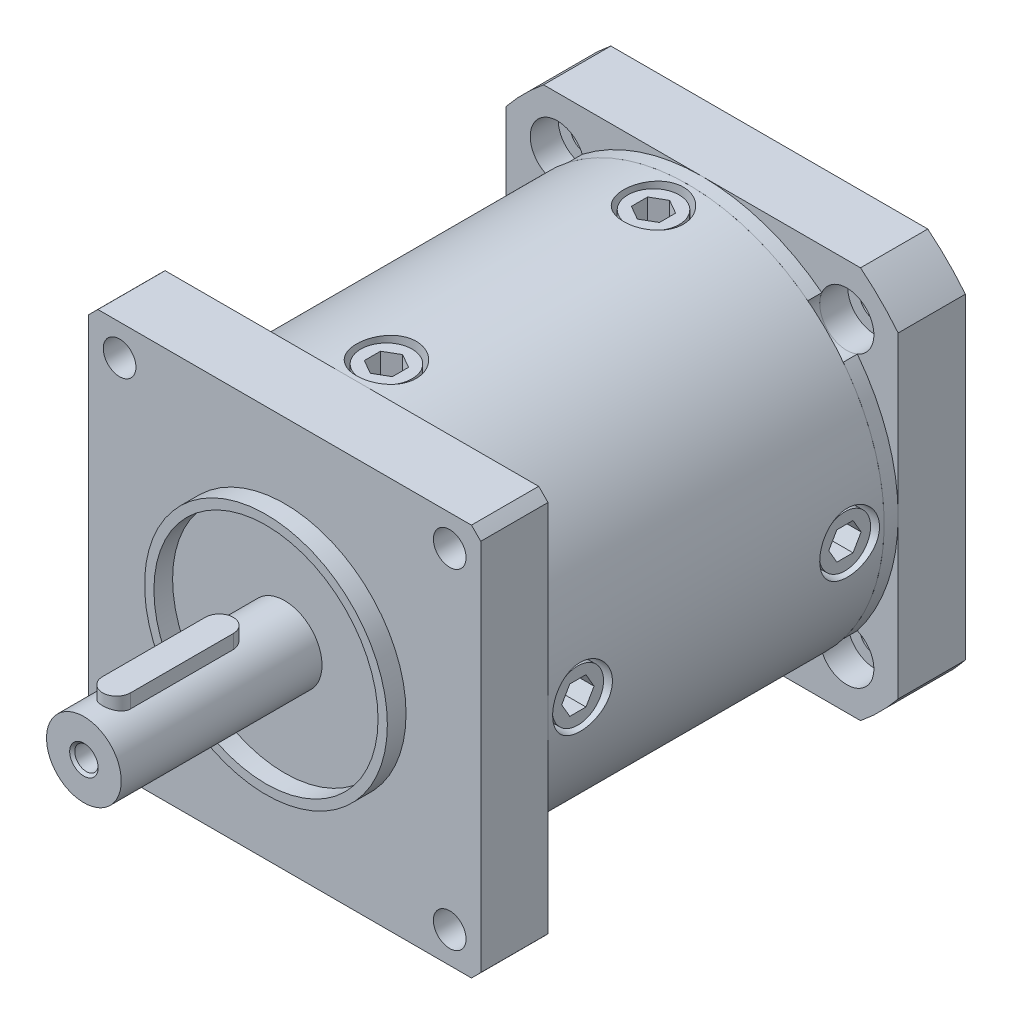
from build123d import *

# Parameters (mm, degrees)
SKETCH_1_R                   = 1.75
EXTRUDE_2_DEPTH              = 7.2
SKETCH_15_R                  = 21
EXTRUDE_8_DEPTH              = 36
SKETCH_17_R                  = 13
SKETCH_17_R_2                = 12
EXTRUDE_9_DEPTH              = 2
SKETCH_18_R                  = 4
EXTRUDE_10_DEPTH             = 21.5
HOLE_WIZARD_M3_1_D           = 2.5
HOLE_WIZARD_M3_1_DEPTH       = 11
HOLE_WIZARD_M3_1_CSINK_D     = 3.05
HOLE_WIZARD_M3_1_CSINK_ANGLE = 90
HOLE_WIZARD_M3_1_TIP         = 0.751075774
EXTRUDE_START                = 2.2
EXTRUDE_11_DEPTH             = 3
SKETCH_25_R                  = 21
EXTRUDE_12_DEPTH             = 1.5
SKETCH_26_R                  = 1.6
EXTRUDE_13_DEPTH             = 7.2
SKETCH_27_R                  = 11
CUT_EXTRUDE_1_DEPTH          = 3
SKETCH_28_R                  = 10
CUT_EXTRUDE_2_DEPTH          = 10
SKETCH_29_R                  = 7.5
EXTRUDE_14_DEPTH             = 8
CUT_EXTRUDE_3_DEPTH          = 7
SKETCH_37_R                  = 2.9
CUT_EXTRUDE_4_DEPTH          = 4.5
SKETCH_38_R                  = 3.2
CUT_EXTRUDE_5_DEPTH          = 3.5
SKETCH_39_R                  = 2.75
EXTRUDE_15_DEPTH             = 3
CUT_EXTRUDE_6_DEPTH          = 3
PATTERN_CIRCULAR_1_COUNT     = 4


with BuildPart() as part:
    # Sketch 1 → Extrude 2 (new body)
    with BuildSketch(Plane.XY):
        with BuildLine():
            Line((-20, -21), (20, -21))
            ThreePointArc((20, -21), (20.506096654, -20.506096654), (21, -20))
            Line((21, -20), (21, 20))
            ThreePointArc((21, 20), (20.506096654, 20.506096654), (20, 21))
            Line((20, 21), (-20, 21))
            ThreePointArc((-20, 21), (-20.506096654, 20.506096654), (-21, 20))
            Line((-21, 20), (-21, -20))
            ThreePointArc((-21, -20), (-20.506096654, -20.506096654), (-20, -21))
        make_face()
        with Locations((-17.67766953, 17.67766953)):
            Circle(SKETCH_1_R, mode=Mode.SUBTRACT)
        with Locations((17.67766953, 17.67766953)):
            Circle(SKETCH_1_R, mode=Mode.SUBTRACT)
        with Locations((17.67766953, -17.67766953)):
            Circle(SKETCH_1_R, mode=Mode.SUBTRACT)
        with Locations((-17.67766953, -17.67766953)):
            Circle(SKETCH_1_R, mode=Mode.SUBTRACT)
    extrude(amount=EXTRUDE_2_DEPTH)

    # Sketch 15 → Extrude 8 (add)
    with BuildSketch(Plane(origin=(0, 0, 0), x_dir=(-1, 0, 0), z_dir=(0, 0, -1))):
        Circle(SKETCH_15_R)
    extrude(amount=EXTRUDE_8_DEPTH)

    # Sketch 17 → Extrude 9 (add)
    with BuildSketch(Plane.XY.offset(7.2)):
        Circle(SKETCH_17_R)
        Circle(SKETCH_17_R_2, mode=Mode.SUBTRACT)
    extrude(amount=EXTRUDE_9_DEPTH)

    # Sketch 18 → Extrude 10 (add)
    with BuildSketch(Plane.XY.offset(7.2)):
        Circle(SKETCH_18_R)
    extrude(amount=EXTRUDE_10_DEPTH)

    # Hole Wizard M3 _1
    with Locations(Plane.XY.offset(28.7)):
        with Locations((0, 0)):
            CounterSinkHole(HOLE_WIZARD_M3_1_D / 2, HOLE_WIZARD_M3_1_CSINK_D / 2, depth=HOLE_WIZARD_M3_1_DEPTH, counter_sink_angle=HOLE_WIZARD_M3_1_CSINK_ANGLE)
            with Locations((0, 0, -(HOLE_WIZARD_M3_1_DEPTH + HOLE_WIZARD_M3_1_TIP / 2))):  # 118° drill point
                Cone(0, HOLE_WIZARD_M3_1_D / 2, HOLE_WIZARD_M3_1_TIP, mode=Mode.SUBTRACT)

    # Sketch 24 → Extrude 11 (add)
    with BuildSketch(Plane(origin=(0, 0, 0), x_dir=(1, 0, 0), z_dir=(0, 1, 0)).offset(EXTRUDE_START)):
        with BuildLine():
            Line((1.5, -14.2), (1.5, -25.2))
            ThreePointArc((1.5, -25.2), (0, -26.7), (-1.5, -25.2))
            Line((-1.5, -25.2), (-1.5, -14.2))
            ThreePointArc((-1.5, -14.2), (0, -12.7), (1.5, -14.2))
        make_face()
    extrude(amount=EXTRUDE_11_DEPTH)


with BuildPart() as body_2:
    # Sketch 25 → Extrude 12 (new body)
    with BuildSketch(Plane(origin=(0, 0, -36), x_dir=(-1, 0, 0), z_dir=(0, 0, -1))):
        Circle(SKETCH_25_R)
    extrude(amount=EXTRUDE_12_DEPTH)


with BuildPart() as body_3:
    # Sketch 26 → Extrude 13 (new body)
    with BuildSketch(Plane(origin=(0, 0, -37.5), x_dir=(-1, 0, 0), z_dir=(0, 0, -1))):
        with BuildLine():
            Line((-16.970562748, 21), (16.970562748, 21))
            ThreePointArc((16.970562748, 21), (19.091883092, 19.091883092), (21, 16.970562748))
            Line((21, 16.970562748), (21, -16.970562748))
            ThreePointArc((21, -16.970562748), (19.091883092, -19.091883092), (16.970562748, -21))
            Line((16.970562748, -21), (-16.970562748, -21))
            ThreePointArc((-16.970562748, -21), (-19.091883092, -19.091883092), (-21, -16.970562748))
            Line((-21, -16.970562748), (-21, 16.970562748))
            ThreePointArc((-21, 16.970562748), (-19.091883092, 19.091883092), (-16.970562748, 21))
        make_face()
        with Locations((-15.5, 15.5)):
            Circle(SKETCH_26_R, mode=Mode.SUBTRACT)
        with Locations((15.5, 15.5)):
            Circle(SKETCH_26_R, mode=Mode.SUBTRACT)
        with Locations((15.5, -15.5)):
            Circle(SKETCH_26_R, mode=Mode.SUBTRACT)
        with Locations((-15.5, -15.5)):
            Circle(SKETCH_26_R, mode=Mode.SUBTRACT)
    extrude(amount=EXTRUDE_13_DEPTH)

    # Sketch 27 → Cut-Extrude 1 (cut)
    with BuildSketch(Plane(origin=(0, 0, -44.7), x_dir=(-1, 0, 0), z_dir=(0, 0, -1))):
        Circle(SKETCH_27_R)
    extrude(amount=-CUT_EXTRUDE_1_DEPTH, mode=Mode.SUBTRACT)


with BuildPart() as cut_extrude_2_tool:
    # Sketch 28 → Cut-Extrude 2 (new body)
    with BuildSketch(Plane(origin=(0, 0, -41.7), x_dir=(-1, 0, 0), z_dir=(0, 0, -1))):
        Circle(SKETCH_28_R)
    extrude(amount=-CUT_EXTRUDE_2_DEPTH)


with BuildPart() as part_1:
    add(part.part)

    # Cut-Extrude 2: cut by cut_extrude_2_tool
    add(cut_extrude_2_tool.part, mode=Mode.SUBTRACT)

    # Sketch 38 → Cut-Extrude 5 (cut)
    with BuildSketch(Plane(origin=(21, 0, 0), x_dir=(0, 0, -1), z_dir=(1, 0, 0))):
        with Locations((3.7, 0)):
            Circle(SKETCH_38_R)
        with Locations((32.3, 0)):
            Circle(SKETCH_38_R)
    cut_extrude_5 = extrude(amount=-CUT_EXTRUDE_5_DEPTH, mode=Mode.SUBTRACT)

    # Sketch 39 → Extrude 15 (add)
    with BuildSketch(Plane(origin=(17.5, 0, 0), x_dir=(0, 0, -1), z_dir=(1, 0, 0))):
        with Locations((3.7, 0)):
            Circle(SKETCH_39_R)
        with Locations((32.3, 0)):
            Circle(SKETCH_39_R)
    extrude_15 = extrude(amount=EXTRUDE_15_DEPTH)

    # Sketch 40 → Cut-Extrude 6 (cut)
    with BuildSketch(Plane(origin=(20.5, 0, 0), x_dir=(0, 0, -1), z_dir=(1, 0, 0))):
        Polygon((5.432050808, 0), (4.566025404, 1.5), (2.833974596, 1.5), (1.967949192, 0), (2.833974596, -1.5), (4.566025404, -1.5), align=None)
        Polygon((30.567949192, 0), (31.433974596, -1.5), (33.166025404, -1.5), (34.032050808, 0), (33.166025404, 1.5), (31.433974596, 1.5), align=None)
    cut_extrude_6 = extrude(amount=-CUT_EXTRUDE_6_DEPTH, mode=Mode.SUBTRACT)

    # Pattern Circular 1: Cut-Extrude 5, Extrude 15, Cut-Extrude 6 ×4 about axis
    pattern_circular_1_axis = Axis((0, 0, 0), (0, 0, 1))
    add([cut_extrude_5.rotate(pattern_circular_1_axis, i * 360 / PATTERN_CIRCULAR_1_COUNT) for i in range(1, PATTERN_CIRCULAR_1_COUNT)], mode=Mode.SUBTRACT)
    add([extrude_15.rotate(pattern_circular_1_axis, i * 360 / PATTERN_CIRCULAR_1_COUNT) for i in range(1, PATTERN_CIRCULAR_1_COUNT)])
    add([cut_extrude_6.rotate(pattern_circular_1_axis, i * 360 / PATTERN_CIRCULAR_1_COUNT) for i in range(1, PATTERN_CIRCULAR_1_COUNT)], mode=Mode.SUBTRACT)


with BuildPart() as body_2_1:
    add(body_2.part)

    # Cut-Extrude 2: cut by cut_extrude_2_tool
    add(cut_extrude_2_tool.part, mode=Mode.SUBTRACT)


with BuildPart() as body_3_1:
    add(body_3.part)

    # Cut-Extrude 2: cut by cut_extrude_2_tool
    add(cut_extrude_2_tool.part, mode=Mode.SUBTRACT)


with BuildPart() as body_4:
    # Sketch 29 → Extrude 14 (new body)
    with BuildSketch(Plane(origin=(0, 0, -31.7), x_dir=(-1, 0, 0), z_dir=(0, 0, -1))):
        Circle(SKETCH_29_R)
    extrude(amount=EXTRUDE_14_DEPTH)

    # Sketch 30 → Cut-Extrude 3 (cut)
    with BuildSketch(Plane(origin=(0, 0, -39.7), x_dir=(-1, 0, 0), z_dir=(0, 0, -1))):
        with BuildLine():
            Line((-1.5, 2), (1.5, 2))
            ThreePointArc((1.5, 2), (0, -2.5), (-1.5, 2))
        make_face()
    extrude(amount=-CUT_EXTRUDE_3_DEPTH, mode=Mode.SUBTRACT)


with BuildPart() as hole_wizard_m3_2_tool:
    # Sketch 33 → Hole Wizard M3 _2 (revolve)
    with BuildSketch(Plane(origin=(0, 2, -36.586884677), x_dir=(0, 0, -1), z_dir=(1, 0, 0))):
        Polygon((0, 0), (0, 8.251075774), (1.25, 7.5), (1.25, 0), align=None)
    revolve(axis=Axis((0, -4.35, -36.586884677), (0, 1, 0)))


with BuildPart() as body_2_2:
    add(body_2_1.part)

    # Hole Wizard M3 _2: cut by hole_wizard_m3_2_tool
    add(hole_wizard_m3_2_tool.part, mode=Mode.SUBTRACT)


with BuildPart() as body_4_1:
    add(body_4.part)

    # Hole Wizard M3 _2: cut by hole_wizard_m3_2_tool
    add(hole_wizard_m3_2_tool.part, mode=Mode.SUBTRACT)


with BuildPart() as cut_extrude_4_tool:
    # Sketch 37 → Cut-Extrude 4 (new body)
    with BuildSketch(Plane.XY.offset(-36)):
        with Locations((15.5, 15.5)):
            Circle(SKETCH_37_R)
        with Locations((15.5, -15.5)):
            Circle(SKETCH_37_R)
        with Locations((-15.5, -15.5)):
            Circle(SKETCH_37_R)
        with Locations((-15.5, 15.5)):
            Circle(SKETCH_37_R)
    extrude(amount=-CUT_EXTRUDE_4_DEPTH)


with BuildPart() as body_2_3:
    add(body_2_2.part)

    # Cut-Extrude 4: cut by cut_extrude_4_tool
    add(cut_extrude_4_tool.part, mode=Mode.SUBTRACT)


with BuildPart() as body_3_2:
    add(body_3_1.part)

    # Cut-Extrude 4: cut by cut_extrude_4_tool
    add(cut_extrude_4_tool.part, mode=Mode.SUBTRACT)


solid = Compound([part_1.part, body_4_1.part, body_2_3.part, body_3_2.part])
